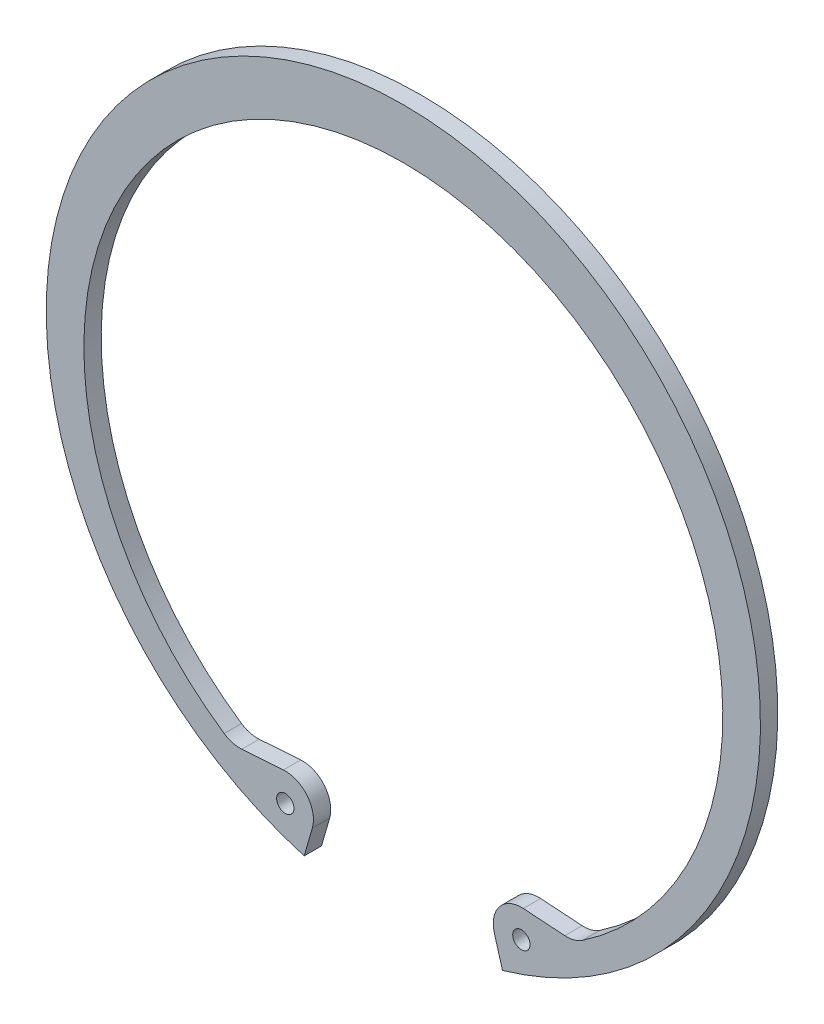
from build123d import *

# Parameters (mm, degrees)
ESQUISSE1_R          = 2
BASE_EXTRUSION_DEPTH = 4


with BuildPart() as part:
    # Esquisse1 → Base-Extrusion (new body)
    with BuildSketch(Plane.XY):
        with BuildLine():
            Line((21.025622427, -72.743887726), (22.907802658, -79.255804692))
            ThreePointArc((22.907802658, -79.255804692), (0, 82.5), (-22.907802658, -79.255804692))
            Line((-22.907802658, -79.255804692), (-21.025622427, -72.743887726))
            ThreePointArc((-21.025622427, -72.743887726), (-22.209927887, -66.859143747), (-27.709717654, -64.453919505))
            Line((-27.709717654, -64.453919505), (-37.304739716, -65.104473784))
            ThreePointArc((-37.304739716, -65.104473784), (-39.439635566, -64.894416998), (-41.38988915, -64.00087623))
            ThreePointArc((-41.38988915, -64.00087623), (0, 70.9), (41.38988915, -64.00087623))
            ThreePointArc((41.38988915, -64.00087623), (39.439635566, -64.894416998), (37.304739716, -65.104473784))
            Line((37.304739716, -65.104473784), (27.709717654, -64.453919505))
            ThreePointArc((27.709717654, -64.453919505), (22.209927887, -66.859143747), (21.025622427, -72.743887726))
        make_face()
        with Locations((27.270019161, -70.939030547)):
            Circle(ESQUISSE1_R, mode=Mode.SUBTRACT)
        with Locations(Location((-27.270019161, -70.939030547, 0), (0, 0, 180))):
            Circle(ESQUISSE1_R, mode=Mode.SUBTRACT)
    extrude(amount=BASE_EXTRUSION_DEPTH)


solid = part.part
